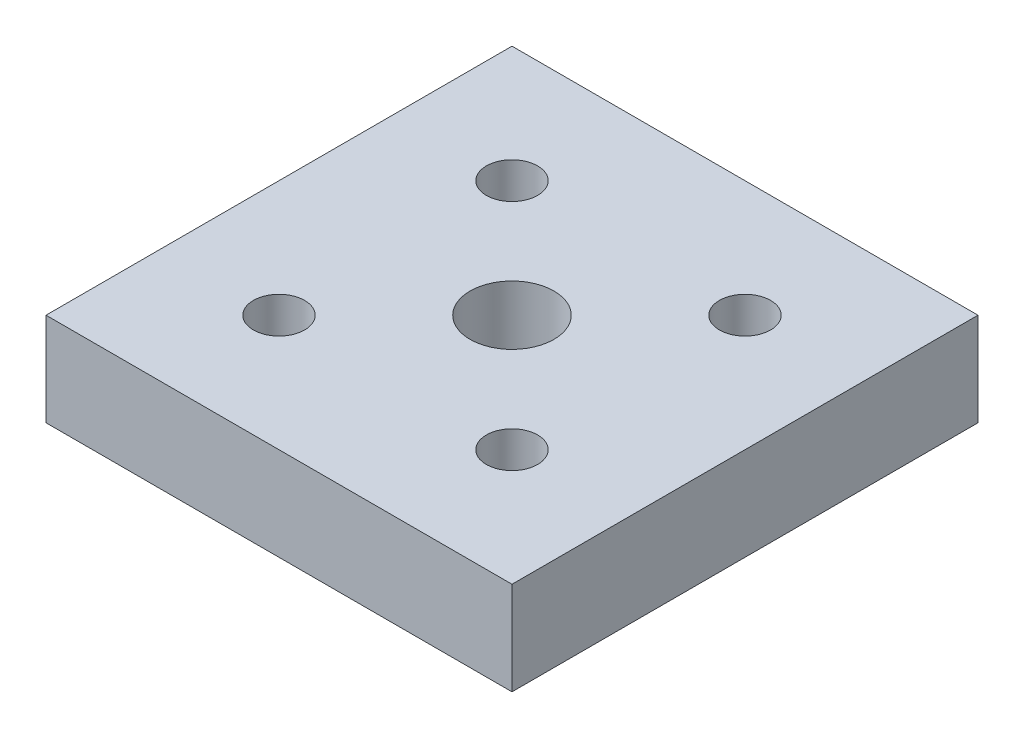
from build123d import *

# Parameters (mm, degrees)
SKETCH_1_W                = 60
SKETCH_1_H                = 60
EXTRUDE_1_DEPTH           = 12
M12X1_25_1_D              = 10.8
HOLE_WIZARD_1_D           = 6.6
HOLE_WIZARD_1_CBORE_D     = 11
HOLE_WIZARD_1_CBORE_DEPTH = 6.5


with BuildPart() as part:
    # Sketch 1 → Extrude 1 (new body)
    with BuildSketch(Plane(origin=(0, 0, 0), x_dir=(1, 0, 0), z_dir=(0, 1, 0))):
        with Locations((30, 30)):
            Rectangle(SKETCH_1_W, SKETCH_1_H)
    extrude(amount=EXTRUDE_1_DEPTH)

    # M12x1.25 _1 (through all)
    with Locations(Plane(origin=(30, 0, -30), x_dir=(0, 0, -1), z_dir=(0, -1, 0))):
        with Locations((0, 0)):
            Hole(M12X1_25_1_D / 2)

    # Hole Wizard 1 (through all)
    with Locations(Plane(origin=(15, 0, -15), x_dir=(0, 0, -1), z_dir=(0, -1, 0))):
        with Locations((0, 0), (0, 30), (30, 30), (30, 0)):
            CounterBoreHole(HOLE_WIZARD_1_D / 2, HOLE_WIZARD_1_CBORE_D / 2, HOLE_WIZARD_1_CBORE_DEPTH)


solid = part.part
